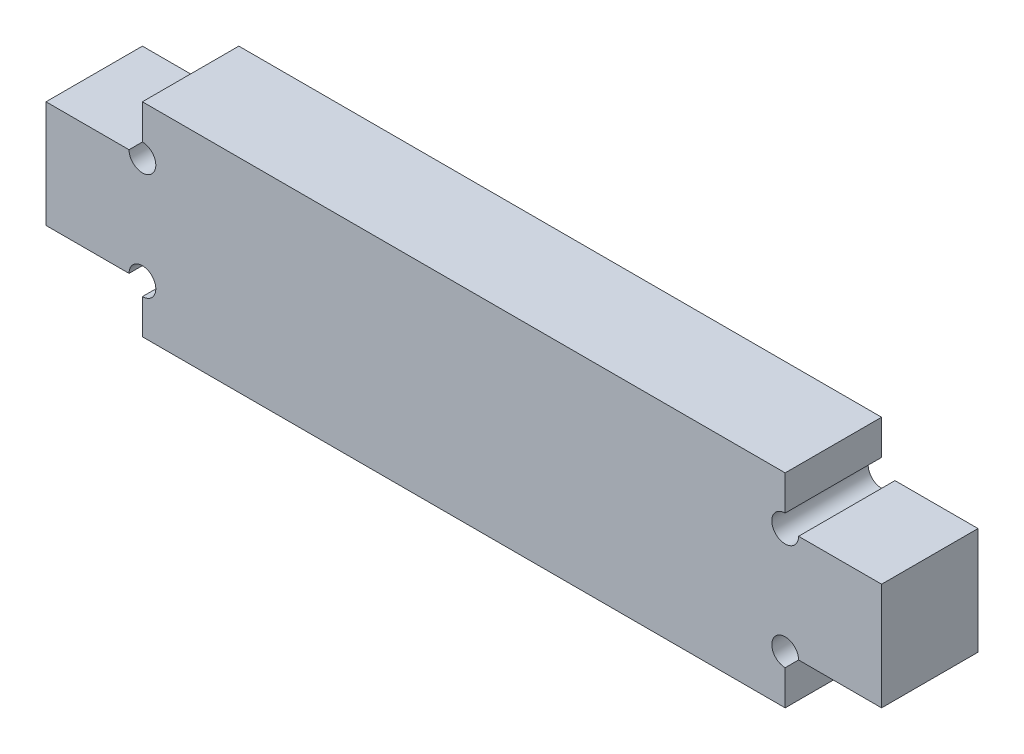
from build123d import *

# Parameters (mm, degrees)
BOSS_EXTRUDE1_DEPTH = 18


with BuildPart() as part:
    # Sketch1 → Boss-Extrude1 (new body)
    with BuildSketch(Plane.XY):
        with BuildLine():
            Line((-60, 19), (60, 19))
            Line((60, 19), (60, 12.5))
            ThreePointArc((60, 12.5), (58.232233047, 8.232233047), (62.5, 10))
            Line((62.5, 10), (78, 10))
            Line((78, 10), (78, -10))
            Line((78, -10), (62.5, -10))
            ThreePointArc((62.5, -10), (58.232233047, -8.232233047), (60, -12.5))
            Line((60, -12.5), (60, -19))
            Line((60, -19), (-60, -19))
            Line((-60, -19), (-60, -12.5))
            ThreePointArc((-60, -12.5), (-58.232233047, -8.232233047), (-62.5, -10))
            Line((-62.5, -10), (-78, -10))
            Line((-78, -10), (-78, 10))
            Line((-78, 10), (-62.5, 10))
            ThreePointArc((-62.5, 10), (-58.232233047, 8.232233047), (-60, 12.5))
            Line((-60, 12.5), (-60, 19))
        make_face()
    extrude(amount=BOSS_EXTRUDE1_DEPTH)


solid = part.part
